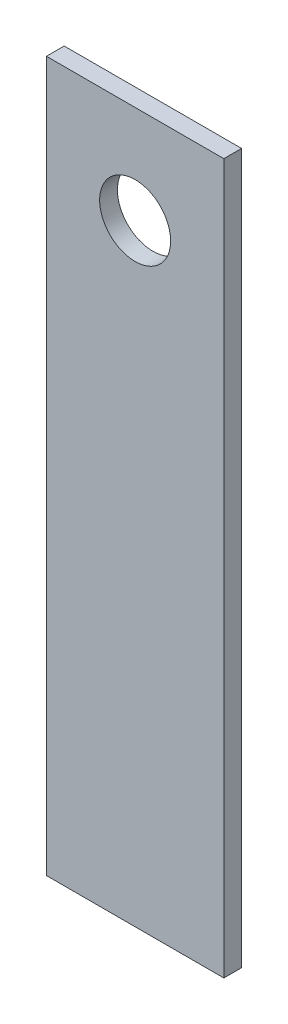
ISO-10303-21;
HEADER;
FILE_DESCRIPTION(('STEP AP214'),'2;1');
FILE_NAME('part.step','',(''),(''),'','','');
FILE_SCHEMA(('AUTOMOTIVE_DESIGN { 1 0 10303 214 1 1 1 1 }'));
ENDSEC;
DATA;
#1=APPLICATION_CONTEXT('core data for automotive mechanical design processes');
#2=APPLICATION_PROTOCOL_DEFINITION('international standard','automotive_design',2000,#1);
#3=PRODUCT_CONTEXT('',#1,'mechanical');
#4=PRODUCT('Part','Part','',(#3));
#5=PRODUCT_RELATED_PRODUCT_CATEGORY('part','',(#4));
#6=PRODUCT_DEFINITION_FORMATION('','',#4);
#7=PRODUCT_DEFINITION_CONTEXT('part definition',#1,'design');
#8=PRODUCT_DEFINITION('design','',#6,#7);
#9=PRODUCT_DEFINITION_SHAPE('','',#8);
#10=(LENGTH_UNIT() NAMED_UNIT(*) SI_UNIT(.MILLI.,.METRE.));
#11=(NAMED_UNIT(*) PLANE_ANGLE_UNIT() SI_UNIT($,.RADIAN.));
#12=(NAMED_UNIT(*) SI_UNIT($,.STERADIAN.) SOLID_ANGLE_UNIT());
#13=UNCERTAINTY_MEASURE_WITH_UNIT(LENGTH_MEASURE(1.E-05),#10,'distance_accuracy_value','');
#14=(GEOMETRIC_REPRESENTATION_CONTEXT(3) GLOBAL_UNCERTAINTY_ASSIGNED_CONTEXT((#13)) GLOBAL_UNIT_ASSIGNED_CONTEXT((#10,
#11,#12)) REPRESENTATION_CONTEXT('',''));
#15=CARTESIAN_POINT('',(0.,0.,0.));
#16=DIRECTION('',(0.,0.,1.));
#17=DIRECTION('',(1.,0.,0.));
#18=AXIS2_PLACEMENT_3D('',#15,#16,#17);
#19=CARTESIAN_POINT('',(-50.,200.,10.));
#20=DIRECTION('',(0.,0.,1.));
#21=DIRECTION('',(1.,0.,0.));
#22=AXIS2_PLACEMENT_3D('',#19,#20,#21);
#23=PLANE('',#22);
#24=DIRECTION('',(0.,-1.,0.));
#25=VECTOR('',#24,1.);
#26=CARTESIAN_POINT('',(-50.,-200.,10.));
#27=LINE('',#26,#25);
#28=CARTESIAN_POINT('',(-50.,200.,10.));
#29=VERTEX_POINT('',#28);
#30=CARTESIAN_POINT('',(-50.,-200.,10.));
#31=VERTEX_POINT('',#30);
#32=EDGE_CURVE('E83',#29,#31,#27,.T.);
#33=ORIENTED_EDGE('',*,*,#32,.T.);
#34=DIRECTION('',(1.,0.,0.));
#35=VECTOR('',#34,1.);
#36=CARTESIAN_POINT('',(50.,-200.,10.));
#37=LINE('',#36,#35);
#38=CARTESIAN_POINT('',(50.,-200.,10.));
#39=VERTEX_POINT('',#38);
#40=EDGE_CURVE('E78',#31,#39,#37,.T.);
#41=ORIENTED_EDGE('',*,*,#40,.T.);
#42=DIRECTION('',(0.,1.,0.));
#43=VECTOR('',#42,1.);
#44=CARTESIAN_POINT('',(50.,-200.,10.));
#45=LINE('',#44,#43);
#46=CARTESIAN_POINT('',(50.,200.,10.));
#47=VERTEX_POINT('',#46);
#48=EDGE_CURVE('E81',#39,#47,#45,.T.);
#49=ORIENTED_EDGE('',*,*,#48,.T.);
#50=DIRECTION('',(-1.,0.,0.));
#51=VECTOR('',#50,1.);
#52=CARTESIAN_POINT('',(50.,200.,10.));
#53=LINE('',#52,#51);
#54=EDGE_CURVE('E48',#47,#29,#53,.T.);
#55=ORIENTED_EDGE('',*,*,#54,.T.);
#56=EDGE_LOOP('',(#33,#41,#49,#55));
#57=FACE_BOUND('',#56,.T.);
#58=CARTESIAN_POINT('',(0.,144.784928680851,10.));
#59=DIRECTION('',(0.,0.,1.));
#60=DIRECTION('',(1.,0.,0.));
#61=AXIS2_PLACEMENT_3D('',#58,#59,#60);
#62=CIRCLE('',#61,20.);
#63=CARTESIAN_POINT('',(20.,144.784928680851,10.));
#64=VERTEX_POINT('',#63);
#65=EDGE_CURVE('E98',#64,#64,#62,.T.);
#66=ORIENTED_EDGE('',*,*,#65,.F.);
#67=EDGE_LOOP('',(#66));
#68=FACE_BOUND('',#67,.T.);
#69=ADVANCED_FACE('F31',(#57,#68),#23,.T.);
#70=CARTESIAN_POINT('',(-50.,200.,0.));
#71=DIRECTION('',(0.,0.,1.));
#72=DIRECTION('',(1.,0.,0.));
#73=AXIS2_PLACEMENT_3D('',#70,#71,#72);
#74=PLANE('',#73);
#75=DIRECTION('',(0.,-1.,0.));
#76=VECTOR('',#75,1.);
#77=CARTESIAN_POINT('',(-50.,-200.,0.));
#78=LINE('',#77,#76);
#79=CARTESIAN_POINT('',(-50.,200.,0.));
#80=VERTEX_POINT('',#79);
#81=CARTESIAN_POINT('',(-50.,-200.,0.));
#82=VERTEX_POINT('',#81);
#83=EDGE_CURVE('E95',#80,#82,#78,.T.);
#84=ORIENTED_EDGE('',*,*,#83,.F.);
#85=DIRECTION('',(-1.,0.,0.));
#86=VECTOR('',#85,1.);
#87=CARTESIAN_POINT('',(50.,200.,0.));
#88=LINE('',#87,#86);
#89=CARTESIAN_POINT('',(50.,200.,0.));
#90=VERTEX_POINT('',#89);
#91=EDGE_CURVE('E71',#90,#80,#88,.T.);
#92=ORIENTED_EDGE('',*,*,#91,.F.);
#93=DIRECTION('',(0.,1.,0.));
#94=VECTOR('',#93,1.);
#95=CARTESIAN_POINT('',(50.,-200.,0.));
#96=LINE('',#95,#94);
#97=CARTESIAN_POINT('',(50.,-200.,0.));
#98=VERTEX_POINT('',#97);
#99=EDGE_CURVE('E65',#98,#90,#96,.T.);
#100=ORIENTED_EDGE('',*,*,#99,.F.);
#101=DIRECTION('',(1.,0.,0.));
#102=VECTOR('',#101,1.);
#103=CARTESIAN_POINT('',(50.,-200.,0.));
#104=LINE('',#103,#102);
#105=EDGE_CURVE('E87',#82,#98,#104,.T.);
#106=ORIENTED_EDGE('',*,*,#105,.F.);
#107=EDGE_LOOP('',(#84,#92,#100,#106));
#108=FACE_BOUND('',#107,.T.);
#109=CARTESIAN_POINT('',(0.,144.784928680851,0.));
#110=DIRECTION('',(0.,0.,1.));
#111=DIRECTION('',(1.,0.,0.));
#112=AXIS2_PLACEMENT_3D('',#109,#110,#111);
#113=CIRCLE('',#112,20.);
#114=CARTESIAN_POINT('',(20.,144.784928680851,0.));
#115=VERTEX_POINT('',#114);
#116=EDGE_CURVE('E110',#115,#115,#113,.T.);
#117=ORIENTED_EDGE('',*,*,#116,.T.);
#118=EDGE_LOOP('',(#117));
#119=FACE_BOUND('',#118,.T.);
#120=ADVANCED_FACE('F106',(#108,#119),#74,.F.);
#121=CARTESIAN_POINT('',(-50.,-200.,10.));
#122=DIRECTION('',(1.,0.,0.));
#123=DIRECTION('',(0.,1.,0.));
#124=AXIS2_PLACEMENT_3D('',#121,#122,#123);
#125=PLANE('',#124);
#126=ORIENTED_EDGE('',*,*,#83,.T.);
#127=DIRECTION('',(0.,0.,-1.));
#128=VECTOR('',#127,1.);
#129=CARTESIAN_POINT('',(-50.,-200.,10.));
#130=LINE('',#129,#128);
#131=EDGE_CURVE('E11',#31,#82,#130,.T.);
#132=ORIENTED_EDGE('',*,*,#131,.F.);
#133=ORIENTED_EDGE('',*,*,#32,.F.);
#134=DIRECTION('',(0.,0.,-1.));
#135=VECTOR('',#134,1.);
#136=CARTESIAN_POINT('',(-50.,200.,10.));
#137=LINE('',#136,#135);
#138=EDGE_CURVE('E91',#29,#80,#137,.T.);
#139=ORIENTED_EDGE('',*,*,#138,.T.);
#140=EDGE_LOOP('',(#126,#132,#133,#139));
#141=FACE_BOUND('',#140,.T.);
#142=ADVANCED_FACE('F33',(#141),#125,.F.);
#143=CARTESIAN_POINT('',(50.,-200.,10.));
#144=DIRECTION('',(0.,1.,0.));
#145=DIRECTION('',(0.,0.,1.));
#146=AXIS2_PLACEMENT_3D('',#143,#144,#145);
#147=PLANE('',#146);
#148=ORIENTED_EDGE('',*,*,#105,.T.);
#149=DIRECTION('',(0.,0.,-1.));
#150=VECTOR('',#149,1.);
#151=CARTESIAN_POINT('',(50.,-200.,10.));
#152=LINE('',#151,#150);
#153=EDGE_CURVE('E40',#39,#98,#152,.T.);
#154=ORIENTED_EDGE('',*,*,#153,.F.);
#155=ORIENTED_EDGE('',*,*,#40,.F.);
#156=ORIENTED_EDGE('',*,*,#131,.T.);
#157=EDGE_LOOP('',(#148,#154,#155,#156));
#158=FACE_BOUND('',#157,.T.);
#159=ADVANCED_FACE('F86',(#158),#147,.F.);
#160=CARTESIAN_POINT('',(50.,-200.,10.));
#161=DIRECTION('',(-1.,0.,0.));
#162=DIRECTION('',(0.,0.,1.));
#163=AXIS2_PLACEMENT_3D('',#160,#161,#162);
#164=PLANE('',#163);
#165=ORIENTED_EDGE('',*,*,#99,.T.);
#166=DIRECTION('',(0.,0.,-1.));
#167=VECTOR('',#166,1.);
#168=CARTESIAN_POINT('',(50.,200.,10.));
#169=LINE('',#168,#167);
#170=EDGE_CURVE('E88',#47,#90,#169,.T.);
#171=ORIENTED_EDGE('',*,*,#170,.F.);
#172=ORIENTED_EDGE('',*,*,#48,.F.);
#173=ORIENTED_EDGE('',*,*,#153,.T.);
#174=EDGE_LOOP('',(#165,#171,#172,#173));
#175=FACE_BOUND('',#174,.T.);
#176=ADVANCED_FACE('F89',(#175),#164,.F.);
#177=CARTESIAN_POINT('',(50.,200.,10.));
#178=DIRECTION('',(0.,-1.,0.));
#179=DIRECTION('',(0.,0.,-1.));
#180=AXIS2_PLACEMENT_3D('',#177,#178,#179);
#181=PLANE('',#180);
#182=ORIENTED_EDGE('',*,*,#91,.T.);
#183=ORIENTED_EDGE('',*,*,#138,.F.);
#184=ORIENTED_EDGE('',*,*,#54,.F.);
#185=ORIENTED_EDGE('',*,*,#170,.T.);
#186=EDGE_LOOP('',(#182,#183,#184,#185));
#187=FACE_BOUND('',#186,.T.);
#188=ADVANCED_FACE('F103',(#187),#181,.F.);
#189=CARTESIAN_POINT('',(0.,144.784928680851,10.));
#190=DIRECTION('',(0.,0.,-1.));
#191=DIRECTION('',(-1.,0.,0.));
#192=AXIS2_PLACEMENT_3D('',#189,#190,#191);
#193=CYLINDRICAL_SURFACE('',#192,20.);
#194=ORIENTED_EDGE('',*,*,#65,.T.);
#195=EDGE_LOOP('',(#194));
#196=FACE_BOUND('',#195,.T.);
#197=ORIENTED_EDGE('',*,*,#116,.F.);
#198=EDGE_LOOP('',(#197));
#199=FACE_BOUND('',#198,.T.);
#200=ADVANCED_FACE('F116',(#196,#199),#193,.F.);
#201=CLOSED_SHELL('',(#69,#120,#142,#159,#176,#188,#200));
#202=MANIFOLD_SOLID_BREP('B2',#201);
#203=ADVANCED_BREP_SHAPE_REPRESENTATION('',(#18,#202),#14);
#204=SHAPE_DEFINITION_REPRESENTATION(#9,#203);
ENDSEC;
END-ISO-10303-21;
